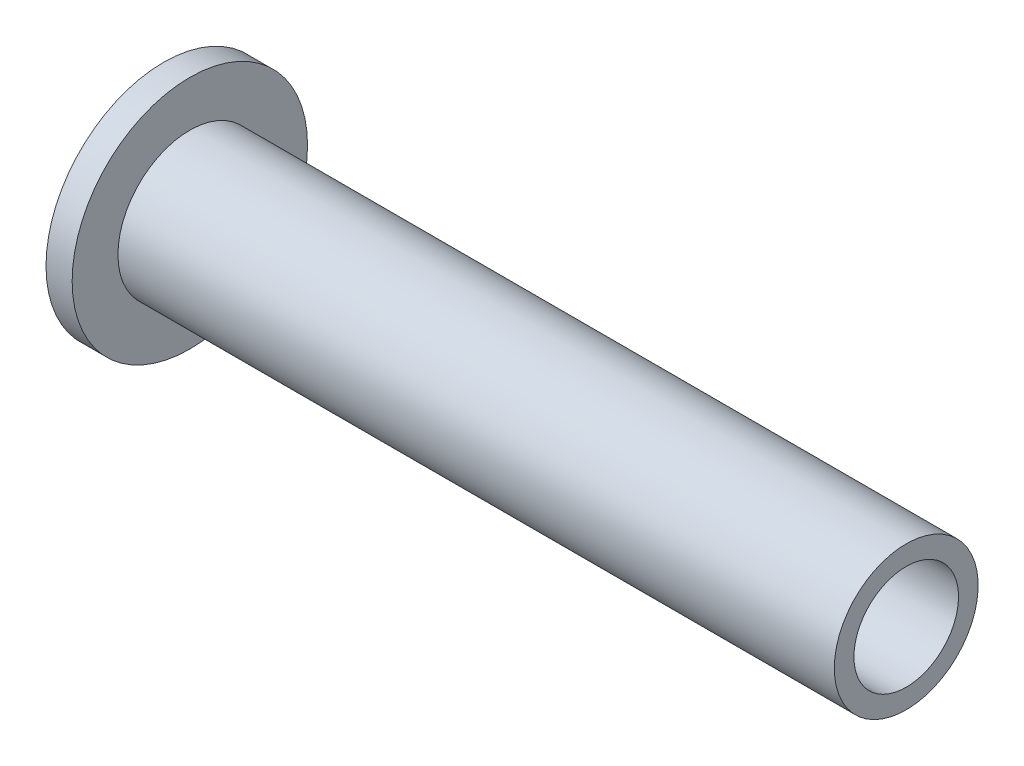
ISO-10303-21;
HEADER;
FILE_DESCRIPTION(('STEP AP214'),'2;1');
FILE_NAME('part.step','',(''),(''),'','','');
FILE_SCHEMA(('AUTOMOTIVE_DESIGN { 1 0 10303 214 1 1 1 1 }'));
ENDSEC;
DATA;
#1=APPLICATION_CONTEXT('core data for automotive mechanical design processes');
#2=APPLICATION_PROTOCOL_DEFINITION('international standard','automotive_design',2000,#1);
#3=PRODUCT_CONTEXT('',#1,'mechanical');
#4=PRODUCT('Part','Part','',(#3));
#5=PRODUCT_RELATED_PRODUCT_CATEGORY('part','',(#4));
#6=PRODUCT_DEFINITION_FORMATION('','',#4);
#7=PRODUCT_DEFINITION_CONTEXT('part definition',#1,'design');
#8=PRODUCT_DEFINITION('design','',#6,#7);
#9=PRODUCT_DEFINITION_SHAPE('','',#8);
#10=(LENGTH_UNIT() NAMED_UNIT(*) SI_UNIT(.MILLI.,.METRE.));
#11=(NAMED_UNIT(*) PLANE_ANGLE_UNIT() SI_UNIT($,.RADIAN.));
#12=(NAMED_UNIT(*) SI_UNIT($,.STERADIAN.) SOLID_ANGLE_UNIT());
#13=UNCERTAINTY_MEASURE_WITH_UNIT(LENGTH_MEASURE(1.E-05),#10,'distance_accuracy_value','');
#14=(GEOMETRIC_REPRESENTATION_CONTEXT(3) GLOBAL_UNCERTAINTY_ASSIGNED_CONTEXT((#13)) GLOBAL_UNIT_ASSIGNED_CONTEXT((#10,
#11,#12)) REPRESENTATION_CONTEXT('',''));
#15=CARTESIAN_POINT('',(0.,0.,0.));
#16=DIRECTION('',(0.,0.,1.));
#17=DIRECTION('',(1.,0.,0.));
#18=AXIS2_PLACEMENT_3D('',#15,#16,#17);
#19=CARTESIAN_POINT('',(0.,9.,0.));
#20=DIRECTION('',(1.,0.,0.));
#21=DIRECTION('',(0.,0.,-1.));
#22=AXIS2_PLACEMENT_3D('',#19,#20,#21);
#23=PLANE('',#22);
#24=CARTESIAN_POINT('',(0.,0.,0.));
#25=DIRECTION('',(-1.,0.,0.));
#26=DIRECTION('',(0.,0.,1.));
#27=AXIS2_PLACEMENT_3D('',#24,#25,#26);
#28=CIRCLE('',#27,4.);
#29=CARTESIAN_POINT('',(0.,0.,4.));
#30=VERTEX_POINT('',#29);
#31=EDGE_CURVE('E48',#30,#30,#28,.T.);
#32=ORIENTED_EDGE('',*,*,#31,.F.);
#33=EDGE_LOOP('',(#32));
#34=FACE_BOUND('',#33,.T.);
#35=CARTESIAN_POINT('',(0.,0.,0.));
#36=DIRECTION('',(-1.,0.,0.));
#37=DIRECTION('',(0.,0.,1.));
#38=AXIS2_PLACEMENT_3D('',#35,#36,#37);
#39=CIRCLE('',#38,9.);
#40=CARTESIAN_POINT('',(0.,0.,9.));
#41=VERTEX_POINT('',#40);
#42=EDGE_CURVE('E10',#41,#41,#39,.T.);
#43=ORIENTED_EDGE('',*,*,#42,.T.);
#44=EDGE_LOOP('',(#43));
#45=FACE_BOUND('',#44,.T.);
#46=ADVANCED_FACE('F26',(#34,#45),#23,.F.);
#47=CARTESIAN_POINT('',(0.,0.,0.));
#48=DIRECTION('',(-1.,0.,0.));
#49=DIRECTION('',(0.,0.,1.));
#50=AXIS2_PLACEMENT_3D('',#47,#48,#49);
#51=CYLINDRICAL_SURFACE('',#50,9.);
#52=ORIENTED_EDGE('',*,*,#42,.F.);
#53=EDGE_LOOP('',(#52));
#54=FACE_BOUND('',#53,.T.);
#55=CARTESIAN_POINT('',(2.,0.,0.));
#56=DIRECTION('',(-1.,0.,0.));
#57=DIRECTION('',(0.,0.,1.));
#58=AXIS2_PLACEMENT_3D('',#55,#56,#57);
#59=CIRCLE('',#58,9.);
#60=CARTESIAN_POINT('',(2.,0.,9.));
#61=VERTEX_POINT('',#60);
#62=EDGE_CURVE('E32',#61,#61,#59,.T.);
#63=ORIENTED_EDGE('',*,*,#62,.T.);
#64=EDGE_LOOP('',(#63));
#65=FACE_BOUND('',#64,.T.);
#66=ADVANCED_FACE('F55',(#54,#65),#51,.T.);
#67=CARTESIAN_POINT('',(2.,5.49999999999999,0.));
#68=DIRECTION('',(-1.,0.,0.));
#69=DIRECTION('',(0.,0.,1.));
#70=AXIS2_PLACEMENT_3D('',#67,#68,#69);
#71=PLANE('',#70);
#72=ORIENTED_EDGE('',*,*,#62,.F.);
#73=EDGE_LOOP('',(#72));
#74=FACE_BOUND('',#73,.T.);
#75=CARTESIAN_POINT('',(2.,0.,0.));
#76=DIRECTION('',(-1.,0.,0.));
#77=DIRECTION('',(0.,0.,1.));
#78=AXIS2_PLACEMENT_3D('',#75,#76,#77);
#79=CIRCLE('',#78,5.49999999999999);
#80=CARTESIAN_POINT('',(2.,0.,5.49999999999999));
#81=VERTEX_POINT('',#80);
#82=EDGE_CURVE('E36',#81,#81,#79,.T.);
#83=ORIENTED_EDGE('',*,*,#82,.T.);
#84=EDGE_LOOP('',(#83));
#85=FACE_BOUND('',#84,.T.);
#86=ADVANCED_FACE('F59',(#74,#85),#71,.F.);
#87=CARTESIAN_POINT('',(0.,0.,0.));
#88=DIRECTION('',(-1.,0.,0.));
#89=DIRECTION('',(0.,0.,1.));
#90=AXIS2_PLACEMENT_3D('',#87,#88,#89);
#91=CYLINDRICAL_SURFACE('',#90,5.5);
#92=ORIENTED_EDGE('',*,*,#82,.F.);
#93=EDGE_LOOP('',(#92));
#94=FACE_BOUND('',#93,.T.);
#95=CARTESIAN_POINT('',(56.7853,0.,0.));
#96=DIRECTION('',(-1.,0.,0.));
#97=DIRECTION('',(0.,0.,1.));
#98=AXIS2_PLACEMENT_3D('',#95,#96,#97);
#99=CIRCLE('',#98,5.5);
#100=CARTESIAN_POINT('',(56.7853,0.,5.5));
#101=VERTEX_POINT('',#100);
#102=EDGE_CURVE('E40',#101,#101,#99,.T.);
#103=ORIENTED_EDGE('',*,*,#102,.T.);
#104=EDGE_LOOP('',(#103));
#105=FACE_BOUND('',#104,.T.);
#106=ADVANCED_FACE('F64',(#94,#105),#91,.T.);
#107=CARTESIAN_POINT('',(56.7853,4.,0.));
#108=DIRECTION('',(-1.,0.,0.));
#109=DIRECTION('',(0.,0.,1.));
#110=AXIS2_PLACEMENT_3D('',#107,#108,#109);
#111=PLANE('',#110);
#112=ORIENTED_EDGE('',*,*,#102,.F.);
#113=EDGE_LOOP('',(#112));
#114=FACE_BOUND('',#113,.T.);
#115=CARTESIAN_POINT('',(56.7853,0.,0.));
#116=DIRECTION('',(-1.,0.,0.));
#117=DIRECTION('',(0.,0.,1.));
#118=AXIS2_PLACEMENT_3D('',#115,#116,#117);
#119=CIRCLE('',#118,4.);
#120=CARTESIAN_POINT('',(56.7853,0.,4.));
#121=VERTEX_POINT('',#120);
#122=EDGE_CURVE('E45',#121,#121,#119,.T.);
#123=ORIENTED_EDGE('',*,*,#122,.T.);
#124=EDGE_LOOP('',(#123));
#125=FACE_BOUND('',#124,.T.);
#126=ADVANCED_FACE('F70',(#114,#125),#111,.F.);
#127=CARTESIAN_POINT('',(0.,0.,0.));
#128=DIRECTION('',(-1.,0.,0.));
#129=DIRECTION('',(0.,0.,1.));
#130=AXIS2_PLACEMENT_3D('',#127,#128,#129);
#131=CYLINDRICAL_SURFACE('',#130,4.);
#132=ORIENTED_EDGE('',*,*,#122,.F.);
#133=EDGE_LOOP('',(#132));
#134=FACE_BOUND('',#133,.T.);
#135=ORIENTED_EDGE('',*,*,#31,.T.);
#136=EDGE_LOOP('',(#135));
#137=FACE_BOUND('',#136,.T.);
#138=ADVANCED_FACE('F52',(#134,#137),#131,.F.);
#139=CLOSED_SHELL('',(#46,#66,#86,#106,#126,#138));
#140=MANIFOLD_SOLID_BREP('B2',#139);
#141=ADVANCED_BREP_SHAPE_REPRESENTATION('',(#18,#140),#14);
#142=SHAPE_DEFINITION_REPRESENTATION(#9,#141);
ENDSEC;
END-ISO-10303-21;
